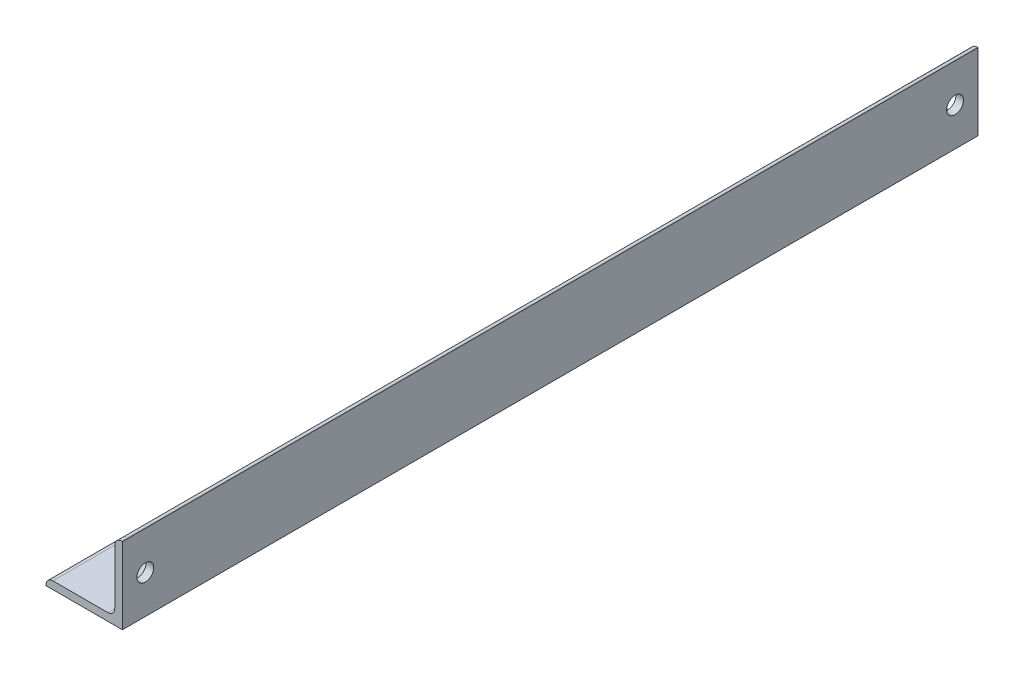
from build123d import *

# Parameters (mm, degrees)
BASE_EXTRUSION_DEPTH    = 560
ESQUISSE2_R             = 5.5
ENL_V_MAT_EXTRU_1_DEPTH = 565.446631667


with BuildPart() as part:
    # Esquisse1 → Base-Extrusion (new body)
    with BuildSketch(Plane.XY):
        with BuildLine():
            Line((0, 0), (0, 50))
            Line((0, 50), (-0.5, 50))
            ThreePointArc((-0.5, 50), (-3.681980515, 48.681980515), (-5, 45.5))
            Line((-5, 45.5), (-5, 9.5))
            ThreePointArc((-5, 9.5), (-6.318019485, 6.318019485), (-9.5, 5))
            Line((-9.5, 5), (-45.5, 5))
            ThreePointArc((-45.5, 5), (-48.681980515, 3.681980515), (-50, 0.5))
            Line((-50, 0.5), (-50, 0))
            Line((-50, 0), (0, 0))
        make_face()
    extrude(amount=BASE_EXTRUSION_DEPTH)

    # Esquisse2 → Enl_v. mat.-Extru.1 (cut, through all)
    with BuildSketch(Plane(origin=(0, 0, 0), x_dir=(0, 0, -1), z_dir=(1, 0, 0))):
        with Locations((-545, 25)):
            Circle(ESQUISSE2_R)
        with Locations((-15, 25)):
            Circle(ESQUISSE2_R)
    extrude(amount=-ENL_V_MAT_EXTRU_1_DEPTH, mode=Mode.SUBTRACT)


solid = part.part
